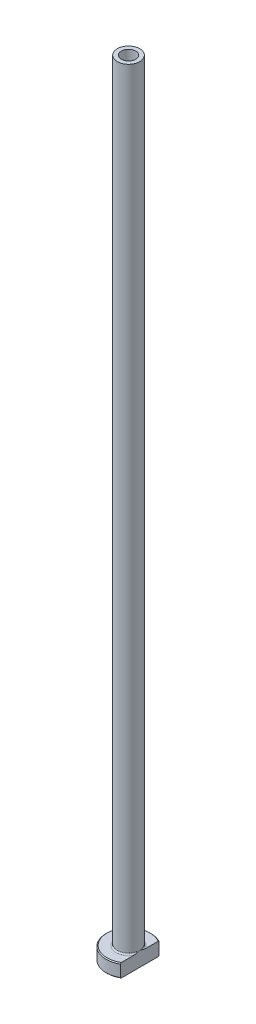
ISO-10303-21;
HEADER;
FILE_DESCRIPTION(('STEP AP214'),'2;1');
FILE_NAME('part.step','',(''),(''),'','','');
FILE_SCHEMA(('AUTOMOTIVE_DESIGN { 1 0 10303 214 1 1 1 1 }'));
ENDSEC;
DATA;
#1=APPLICATION_CONTEXT('core data for automotive mechanical design processes');
#2=APPLICATION_PROTOCOL_DEFINITION('international standard','automotive_design',2000,#1);
#3=PRODUCT_CONTEXT('',#1,'mechanical');
#4=PRODUCT('Part','Part','',(#3));
#5=PRODUCT_RELATED_PRODUCT_CATEGORY('part','',(#4));
#6=PRODUCT_DEFINITION_FORMATION('','',#4);
#7=PRODUCT_DEFINITION_CONTEXT('part definition',#1,'design');
#8=PRODUCT_DEFINITION('design','',#6,#7);
#9=PRODUCT_DEFINITION_SHAPE('','',#8);
#10=(LENGTH_UNIT() NAMED_UNIT(*) SI_UNIT(.MILLI.,.METRE.));
#11=(NAMED_UNIT(*) PLANE_ANGLE_UNIT() SI_UNIT($,.RADIAN.));
#12=(NAMED_UNIT(*) SI_UNIT($,.STERADIAN.) SOLID_ANGLE_UNIT());
#13=UNCERTAINTY_MEASURE_WITH_UNIT(LENGTH_MEASURE(1.E-05),#10,'distance_accuracy_value','');
#14=(GEOMETRIC_REPRESENTATION_CONTEXT(3) GLOBAL_UNCERTAINTY_ASSIGNED_CONTEXT((#13)) GLOBAL_UNIT_ASSIGNED_CONTEXT((#10,
#11,#12)) REPRESENTATION_CONTEXT('',''));
#15=CARTESIAN_POINT('',(0.,0.,0.));
#16=DIRECTION('',(0.,0.,1.));
#17=DIRECTION('',(1.,0.,0.));
#18=AXIS2_PLACEMENT_3D('',#15,#16,#17);
#19=CARTESIAN_POINT('',(0.,92.1876809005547,0.));
#20=DIRECTION('',(0.,1.,0.));
#21=DIRECTION('',(0.,0.,1.));
#22=AXIS2_PLACEMENT_3D('',#19,#20,#21);
#23=CYLINDRICAL_SURFACE('',#22,1.6);
#24=CARTESIAN_POINT('',(0.,175.,0.));
#25=DIRECTION('',(0.,1.,0.));
#26=DIRECTION('',(0.,0.,1.));
#27=AXIS2_PLACEMENT_3D('',#24,#25,#26);
#28=CIRCLE('',#27,1.6);
#29=CARTESIAN_POINT('',(0.,175.,1.6));
#30=VERTEX_POINT('',#29);
#31=EDGE_CURVE('E167',#30,#30,#28,.T.);
#32=ORIENTED_EDGE('',*,*,#31,.T.);
#33=EDGE_LOOP('',(#32));
#34=FACE_BOUND('',#33,.T.);
#35=CARTESIAN_POINT('',(0.,130.,0.));
#36=DIRECTION('',(0.,1.,0.));
#37=DIRECTION('',(0.,0.,1.));
#38=AXIS2_PLACEMENT_3D('',#35,#36,#37);
#39=CIRCLE('',#38,1.6);
#40=CARTESIAN_POINT('',(0.,130.,1.6));
#41=VERTEX_POINT('',#40);
#42=EDGE_CURVE('E170',#41,#41,#39,.T.);
#43=ORIENTED_EDGE('',*,*,#42,.F.);
#44=EDGE_LOOP('',(#43));
#45=FACE_BOUND('',#44,.T.);
#46=ADVANCED_FACE('F32',(#34,#45),#23,.F.);
#47=CARTESIAN_POINT('',(-1.6,175.,0.));
#48=DIRECTION('',(0.,1.,0.));
#49=DIRECTION('',(0.,0.,1.));
#50=AXIS2_PLACEMENT_3D('',#47,#48,#49);
#51=PLANE('',#50);
#52=CARTESIAN_POINT('',(0.,175.,0.));
#53=DIRECTION('',(0.,1.,0.));
#54=DIRECTION('',(0.,0.,1.));
#55=AXIS2_PLACEMENT_3D('',#52,#53,#54);
#56=CIRCLE('',#55,2.50000000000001);
#57=CARTESIAN_POINT('',(0.,175.,2.50000000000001));
#58=VERTEX_POINT('',#57);
#59=EDGE_CURVE('E174',#58,#58,#56,.T.);
#60=ORIENTED_EDGE('',*,*,#59,.T.);
#61=EDGE_LOOP('',(#60));
#62=FACE_BOUND('',#61,.T.);
#63=ORIENTED_EDGE('',*,*,#31,.F.);
#64=EDGE_LOOP('',(#63));
#65=FACE_BOUND('',#64,.T.);
#66=ADVANCED_FACE('F157',(#62,#65),#51,.T.);
#67=CARTESIAN_POINT('',(0.,92.1876809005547,0.));
#68=DIRECTION('',(0.,1.,0.));
#69=DIRECTION('',(0.,0.,1.));
#70=AXIS2_PLACEMENT_3D('',#67,#68,#69);
#71=CYLINDRICAL_SURFACE('',#70,2.5);
#72=CARTESIAN_POINT('',(0.,3.3,0.));
#73=DIRECTION('',(0.,1.,0.));
#74=DIRECTION('',(0.,0.,1.));
#75=AXIS2_PLACEMENT_3D('',#72,#73,#74);
#76=CIRCLE('',#75,2.5);
#77=CARTESIAN_POINT('',(2.5,3.3,0.));
#78=VERTEX_POINT('',#77);
#79=EDGE_CURVE('E180',#78,#78,#76,.T.);
#80=ORIENTED_EDGE('',*,*,#79,.T.);
#81=EDGE_LOOP('',(#80));
#82=FACE_BOUND('',#81,.T.);
#83=ORIENTED_EDGE('',*,*,#59,.F.);
#84=EDGE_LOOP('',(#83));
#85=FACE_BOUND('',#84,.T.);
#86=ADVANCED_FACE('F162',(#82,#85),#71,.T.);
#87=CARTESIAN_POINT('',(-2.49999999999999,3.,0.));
#88=DIRECTION('',(0.,1.,0.));
#89=DIRECTION('',(0.,0.,1.));
#90=AXIS2_PLACEMENT_3D('',#87,#88,#89);
#91=PLANE('',#90);
#92=DIRECTION('',(0.,0.,1.));
#93=VECTOR('',#92,1.);
#94=CARTESIAN_POINT('',(2.49999999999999,3.,0.));
#95=LINE('',#94,#93);
#96=CARTESIAN_POINT('',(2.49999999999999,3.,-4.09756024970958));
#97=VERTEX_POINT('',#96);
#98=CARTESIAN_POINT('',(2.49999999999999,3.,-1.26095202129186));
#99=VERTEX_POINT('',#98);
#100=EDGE_CURVE('E54',#97,#99,#95,.T.);
#101=ORIENTED_EDGE('',*,*,#100,.F.);
#102=CARTESIAN_POINT('',(0.,3.,0.));
#103=DIRECTION('',(0.,1.,0.));
#104=DIRECTION('',(0.,0.,1.));
#105=AXIS2_PLACEMENT_3D('',#102,#103,#104);
#106=CIRCLE('',#105,4.8);
#107=CARTESIAN_POINT('',(2.49999999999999,3.,4.09756024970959));
#108=VERTEX_POINT('',#107);
#109=EDGE_CURVE('E186',#97,#108,#106,.T.);
#110=ORIENTED_EDGE('',*,*,#109,.T.);
#111=CARTESIAN_POINT('',(2.49999999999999,3.,1.26095202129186));
#112=VERTEX_POINT('',#111);
#113=EDGE_CURVE('E134',#112,#108,#95,.T.);
#114=ORIENTED_EDGE('',*,*,#113,.F.);
#115=CARTESIAN_POINT('',(0.,3.,0.));
#116=DIRECTION('',(0.,1.,0.));
#117=DIRECTION('',(0.,0.,1.));
#118=AXIS2_PLACEMENT_3D('',#115,#116,#117);
#119=CIRCLE('',#118,2.8);
#120=EDGE_CURVE('E183',#112,#99,#119,.F.);
#121=ORIENTED_EDGE('',*,*,#120,.T.);
#122=EDGE_LOOP('',(#101,#110,#114,#121));
#123=FACE_BOUND('',#122,.T.);
#124=ADVANCED_FACE('F197',(#123),#91,.T.);
#125=CARTESIAN_POINT('',(0.,92.1876809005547,0.));
#126=DIRECTION('',(0.,1.,0.));
#127=DIRECTION('',(0.,0.,1.));
#128=AXIS2_PLACEMENT_3D('',#125,#126,#127);
#129=CYLINDRICAL_SURFACE('',#128,4.99999999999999);
#130=DIRECTION('',(0.,-1.,0.));
#131=VECTOR('',#130,1.);
#132=CARTESIAN_POINT('',(2.49999999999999,175.,4.33012701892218));
#133=LINE('',#132,#131);
#134=CARTESIAN_POINT('',(2.49999999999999,2.8,4.33012701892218));
#135=VERTEX_POINT('',#134);
#136=CARTESIAN_POINT('',(2.49999999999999,0.200000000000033,4.33012701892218));
#137=VERTEX_POINT('',#136);
#138=EDGE_CURVE('E82',#135,#137,#133,.T.);
#139=ORIENTED_EDGE('',*,*,#138,.F.);
#140=CARTESIAN_POINT('',(0.,2.8,0.));
#141=DIRECTION('',(0.,1.,0.));
#142=DIRECTION('',(0.,0.,1.));
#143=AXIS2_PLACEMENT_3D('',#140,#141,#142);
#144=CIRCLE('',#143,4.99999999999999);
#145=CARTESIAN_POINT('',(2.49999999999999,2.8,-4.33012701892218));
#146=VERTEX_POINT('',#145);
#147=EDGE_CURVE('E95',#135,#146,#144,.F.);
#148=ORIENTED_EDGE('',*,*,#147,.T.);
#149=DIRECTION('',(0.,-1.,0.));
#150=VECTOR('',#149,1.);
#151=CARTESIAN_POINT('',(2.49999999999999,175.,-4.33012701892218));
#152=LINE('',#151,#150);
#153=CARTESIAN_POINT('',(2.49999999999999,0.200000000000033,-4.33012701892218));
#154=VERTEX_POINT('',#153);
#155=EDGE_CURVE('E192',#146,#154,#152,.T.);
#156=ORIENTED_EDGE('',*,*,#155,.T.);
#157=CARTESIAN_POINT('',(0.,0.200000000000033,0.));
#158=DIRECTION('',(0.,-1.,0.));
#159=DIRECTION('',(0.,0.,-1.));
#160=AXIS2_PLACEMENT_3D('',#157,#158,#159);
#161=CIRCLE('',#160,4.99999999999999);
#162=EDGE_CURVE('E98',#154,#137,#161,.F.);
#163=ORIENTED_EDGE('',*,*,#162,.T.);
#164=EDGE_LOOP('',(#139,#148,#156,#163));
#165=FACE_BOUND('',#164,.T.);
#166=ADVANCED_FACE('F190',(#165),#129,.T.);
#167=CARTESIAN_POINT('',(-4.99999999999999,0.,0.));
#168=DIRECTION('',(0.,-1.,0.));
#169=DIRECTION('',(0.,0.,-1.));
#170=AXIS2_PLACEMENT_3D('',#167,#168,#169);
#171=PLANE('',#170);
#172=CARTESIAN_POINT('',(0.,0.,0.));
#173=DIRECTION('',(0.,-1.,0.));
#174=DIRECTION('',(0.,0.,-1.));
#175=AXIS2_PLACEMENT_3D('',#172,#173,#174);
#176=CIRCLE('',#175,2.34999999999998);
#177=CARTESIAN_POINT('',(0.,0.,-2.34999999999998));
#178=VERTEX_POINT('',#177);
#179=EDGE_CURVE('E40',#178,#178,#176,.F.);
#180=ORIENTED_EDGE('',*,*,#179,.T.);
#181=EDGE_LOOP('',(#180));
#182=FACE_BOUND('',#181,.T.);
#183=DIRECTION('',(0.,0.,-1.));
#184=VECTOR('',#183,1.);
#185=CARTESIAN_POINT('',(2.49999999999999,0.,4.33012701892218));
#186=LINE('',#185,#184);
#187=CARTESIAN_POINT('',(2.49999999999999,0.,4.09756024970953));
#188=VERTEX_POINT('',#187);
#189=CARTESIAN_POINT('',(2.49999999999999,0.,-4.09756024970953));
#190=VERTEX_POINT('',#189);
#191=EDGE_CURVE('E47',#188,#190,#186,.T.);
#192=ORIENTED_EDGE('',*,*,#191,.F.);
#193=CARTESIAN_POINT('',(0.,0.,0.));
#194=DIRECTION('',(0.,-1.,0.));
#195=DIRECTION('',(0.,0.,-1.));
#196=AXIS2_PLACEMENT_3D('',#193,#194,#195);
#197=CIRCLE('',#196,4.79999999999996);
#198=EDGE_CURVE('E92',#188,#190,#197,.T.);
#199=ORIENTED_EDGE('',*,*,#198,.T.);
#200=EDGE_LOOP('',(#192,#199));
#201=FACE_BOUND('',#200,.T.);
#202=ADVANCED_FACE('F91',(#182,#201),#171,.T.);
#203=CARTESIAN_POINT('',(0.,92.1876809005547,0.));
#204=DIRECTION('',(0.,1.,0.));
#205=DIRECTION('',(0.,0.,1.));
#206=AXIS2_PLACEMENT_3D('',#203,#204,#205);
#207=CYLINDRICAL_SURFACE('',#206,1.85);
#208=CARTESIAN_POINT('',(0.,0.499999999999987,0.));
#209=DIRECTION('',(0.,-1.,0.));
#210=DIRECTION('',(0.,0.,-1.));
#211=AXIS2_PLACEMENT_3D('',#208,#209,#210);
#212=CIRCLE('',#211,1.85);
#213=CARTESIAN_POINT('',(0.,0.499999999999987,-1.85));
#214=VERTEX_POINT('',#213);
#215=EDGE_CURVE('E11',#214,#214,#212,.T.);
#216=ORIENTED_EDGE('',*,*,#215,.T.);
#217=EDGE_LOOP('',(#216));
#218=FACE_BOUND('',#217,.T.);
#219=CARTESIAN_POINT('',(0.,118.,0.));
#220=DIRECTION('',(0.,1.,0.));
#221=DIRECTION('',(0.,0.,1.));
#222=AXIS2_PLACEMENT_3D('',#219,#220,#221);
#223=CIRCLE('',#222,1.85);
#224=CARTESIAN_POINT('',(0.,118.,1.85));
#225=VERTEX_POINT('',#224);
#226=EDGE_CURVE('E172',#225,#225,#223,.T.);
#227=ORIENTED_EDGE('',*,*,#226,.T.);
#228=EDGE_LOOP('',(#227));
#229=FACE_BOUND('',#228,.T.);
#230=ADVANCED_FACE('F215',(#218,#229),#207,.F.);
#231=CARTESIAN_POINT('',(0.,118.,0.));
#232=DIRECTION('',(0.,-1.,0.));
#233=DIRECTION('',(0.,0.,-1.));
#234=AXIS2_PLACEMENT_3D('',#231,#232,#233);
#235=CONICAL_SURFACE('',#234,1.85,0.0208303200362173);
#236=ORIENTED_EDGE('',*,*,#42,.T.);
#237=EDGE_LOOP('',(#236));
#238=FACE_BOUND('',#237,.T.);
#239=ORIENTED_EDGE('',*,*,#226,.F.);
#240=EDGE_LOOP('',(#239));
#241=FACE_BOUND('',#240,.T.);
#242=ADVANCED_FACE('F111',(#238,#241),#235,.F.);
#243=CARTESIAN_POINT('',(0.,3.3,0.));
#244=DIRECTION('',(0.,1.,0.));
#245=DIRECTION('',(0.,0.,1.));
#246=AXIS2_PLACEMENT_3D('',#243,#244,#245);
#247=TOROIDAL_SURFACE('',#246,2.8,0.3);
#248=ORIENTED_EDGE('',*,*,#120,.F.);
#249=CARTESIAN_POINT('',(2.5,3.3,0.));
#250=CARTESIAN_POINT('',(2.5,3.30000062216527,-4.842640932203E-11));
#251=CARTESIAN_POINT('',(2.5,3.30000124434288,1.59621029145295E-07));
#252=CARTESIAN_POINT('',(2.5,3.30000243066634,6.45477909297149E-07));
#253=CARTESIAN_POINT('',(2.5,3.30000299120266,9.78480635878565E-07));
#254=CARTESIAN_POINT('',(2.5,3.3000041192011,1.77471971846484E-06));
#255=CARTESIAN_POINT('',(2.5,3.30000467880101,2.24902134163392E-06));
#256=CARTESIAN_POINT('',(2.5,3.30000572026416,3.25953670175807E-06));
#257=CARTESIAN_POINT('',(2.5,3.30000620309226,3.7948073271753E-06));
#258=CARTESIAN_POINT('',(2.5,3.30000787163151,5.75794622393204E-06));
#259=CARTESIAN_POINT('',(2.5,3.30000896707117,7.26424112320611E-06));
#260=CARTESIAN_POINT('',(2.5,3.30001087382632,1.0336113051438E-05));
#261=CARTESIAN_POINT('',(2.5,3.30001169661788,1.18949500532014E-05));
#262=CARTESIAN_POINT('',(2.5,3.30001489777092,1.81400854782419E-05));
#263=CARTESIAN_POINT('',(2.5,3.30001712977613,2.29062182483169E-05));
#264=CARTESIAN_POINT('',(2.5,3.3000206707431,3.21793872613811E-05));
#265=CARTESIAN_POINT('',(2.5,3.30002205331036,3.66588994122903E-05));
#266=CARTESIAN_POINT('',(2.5,3.30002810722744,5.61718413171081E-05));
#267=CARTESIAN_POINT('',(2.5,3.30003284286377,7.11735877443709E-05));
#268=CARTESIAN_POINT('',(2.5,3.30004025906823,9.89920342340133E-05));
#269=CARTESIAN_POINT('',(2.49999999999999,3.30004315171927,0.000111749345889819));
#270=CARTESIAN_POINT('',(2.49999999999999,3.30006652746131,0.000206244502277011));
#271=CARTESIAN_POINT('',(2.49999999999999,3.30009698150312,0.000285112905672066));
#272=CARTESIAN_POINT('',(2.5,3.30021213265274,0.000594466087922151));
#273=CARTESIAN_POINT('',(2.5,3.30028938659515,0.000826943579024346));
#274=CARTESIAN_POINT('',(2.49999999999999,3.30059681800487,0.00173885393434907));
#275=CARTESIAN_POINT('',(2.49999999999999,3.30083479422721,0.00241625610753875));
#276=CARTESIAN_POINT('',(2.5,3.30181198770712,0.00521069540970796));
#277=CARTESIAN_POINT('',(2.5,3.30254240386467,0.00732996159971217));
#278=CARTESIAN_POINT('',(2.49999999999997,3.31226043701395,0.0355096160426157));
#279=CARTESIAN_POINT('',(2.49999999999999,3.32130808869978,0.0615551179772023));
#280=CARTESIAN_POINT('',(2.5,3.33896212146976,0.112677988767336));
#281=CARTESIAN_POINT('',(2.5,3.34757212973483,0.137754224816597));
#282=CARTESIAN_POINT('',(2.49999999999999,3.36573068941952,0.190981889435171));
#283=CARTESIAN_POINT('',(2.49999999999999,3.37526654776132,0.219137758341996));
#284=CARTESIAN_POINT('',(2.49999999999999,3.39422867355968,0.275816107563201));
#285=CARTESIAN_POINT('',(2.49999999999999,3.40365272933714,0.304339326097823));
#286=CARTESIAN_POINT('',(2.49999999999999,3.42641697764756,0.374416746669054));
#287=CARTESIAN_POINT('',(2.49999999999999,3.43959811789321,0.416023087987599));
#288=CARTESIAN_POINT('',(2.49999999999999,3.46479157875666,0.498481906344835));
#289=CARTESIAN_POINT('',(2.49999999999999,3.47682455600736,0.539328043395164));
#290=CARTESIAN_POINT('',(2.49999999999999,3.50224427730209,0.629981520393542));
#291=CARTESIAN_POINT('',(2.49999999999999,3.5153804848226,0.679860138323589));
#292=CARTESIAN_POINT('',(2.49999999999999,3.53964074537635,0.780511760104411));
#293=CARTESIAN_POINT('',(2.49999999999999,3.55074877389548,0.831288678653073));
#294=CARTESIAN_POINT('',(2.49999999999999,3.57087054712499,0.937063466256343));
#295=CARTESIAN_POINT('',(2.49999999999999,3.57967623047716,0.992102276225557));
#296=CARTESIAN_POINT('',(2.49999999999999,3.59301148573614,1.10256024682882));
#297=CARTESIAN_POINT('',(2.49999999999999,3.59755297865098,1.15797790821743));
#298=CARTESIAN_POINT('',(2.49999999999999,3.60093314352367,1.26786705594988));
#299=CARTESIAN_POINT('',(2.49999999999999,3.59989366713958,1.32233291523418));
#300=CARTESIAN_POINT('',(2.49999999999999,3.59277279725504,1.403100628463));
#301=CARTESIAN_POINT('',(2.49999999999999,3.58952137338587,1.42965222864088));
#302=CARTESIAN_POINT('',(2.49999999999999,3.58085857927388,1.48239078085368));
#303=CARTESIAN_POINT('',(2.49999999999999,3.57544928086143,1.50857805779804));
#304=CARTESIAN_POINT('',(2.49999999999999,3.56298810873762,1.55658799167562));
#305=CARTESIAN_POINT('',(2.49999999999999,3.55628200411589,1.57849902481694));
#306=CARTESIAN_POINT('',(2.49999999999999,3.54055393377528,1.62160292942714));
#307=CARTESIAN_POINT('',(2.49999999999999,3.53152220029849,1.64279233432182));
#308=CARTESIAN_POINT('',(2.49999999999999,3.51057199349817,1.6840446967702));
#309=CARTESIAN_POINT('',(2.49999999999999,3.49862012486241,1.704091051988));
#310=CARTESIAN_POINT('',(2.49999999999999,3.47134074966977,1.74172093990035));
#311=CARTESIAN_POINT('',(2.49999999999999,3.45603127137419,1.75931683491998));
#312=CARTESIAN_POINT('',(2.49999999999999,3.42979930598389,1.78297070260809));
#313=CARTESIAN_POINT('',(2.49999999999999,3.42024268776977,1.79054141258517));
#314=CARTESIAN_POINT('',(2.49999999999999,3.40009035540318,1.80416997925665));
#315=CARTESIAN_POINT('',(2.49999999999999,3.38949499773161,1.81022835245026));
#316=CARTESIAN_POINT('',(2.49999999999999,3.36727740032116,1.82047087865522));
#317=CARTESIAN_POINT('',(2.49999999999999,3.35564531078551,1.82463409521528));
#318=CARTESIAN_POINT('',(2.49999999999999,3.33178837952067,1.83058442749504));
#319=CARTESIAN_POINT('',(2.49999999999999,3.31956435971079,1.83237474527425));
#320=CARTESIAN_POINT('',(2.49999999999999,3.29665736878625,1.83331852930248));
#321=CARTESIAN_POINT('',(2.49999999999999,3.2859867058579,1.83279233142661));
#322=CARTESIAN_POINT('',(2.49999999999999,3.26490749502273,1.82986307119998));
#323=CARTESIAN_POINT('',(2.49999999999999,3.25449899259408,1.82745968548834));
#324=CARTESIAN_POINT('',(2.49999999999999,3.23467098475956,1.82111257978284));
#325=CARTESIAN_POINT('',(2.49999999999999,3.22522816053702,1.81724026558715));
#326=CARTESIAN_POINT('',(2.49999999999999,3.20699535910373,1.80819497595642));
#327=CARTESIAN_POINT('',(2.49999999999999,3.19820556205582,1.80302164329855));
#328=CARTESIAN_POINT('',(2.49999999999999,3.1766316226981,1.78842115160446));
#329=CARTESIAN_POINT('',(2.49999999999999,3.16436228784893,1.77823293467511));
#330=CARTESIAN_POINT('',(2.49999999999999,3.14157828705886,1.75604629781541));
#331=CARTESIAN_POINT('',(2.49999999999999,3.13106906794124,1.74404246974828));
#332=CARTESIAN_POINT('',(2.49999999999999,3.10600520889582,1.71142114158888));
#333=CARTESIAN_POINT('',(2.49999999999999,3.09267476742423,1.68986887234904));
#334=CARTESIAN_POINT('',(2.49999999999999,3.06940323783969,1.64508572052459));
#335=CARTESIAN_POINT('',(2.49999999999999,3.05946314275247,1.62185434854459));
#336=CARTESIAN_POINT('',(2.49999999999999,3.03545750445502,1.55546754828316));
#337=CARTESIAN_POINT('',(2.49999999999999,3.02444022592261,1.51122187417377));
#338=CARTESIAN_POINT('',(2.49999999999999,3.00863926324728,1.42119777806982));
#339=CARTESIAN_POINT('',(2.49999999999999,3.00393876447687,1.37540689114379));
#340=CARTESIAN_POINT('',(2.49999999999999,2.9992421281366,1.28072198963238));
#341=CARTESIAN_POINT('',(2.49999999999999,2.99956098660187,1.23181420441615));
#342=CARTESIAN_POINT('',(2.49999999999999,3.00436098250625,1.13410944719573));
#343=CARTESIAN_POINT('',(2.49999999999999,3.00885327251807,1.08531312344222));
#344=CARTESIAN_POINT('',(2.49999999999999,3.02074191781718,0.990773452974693));
#345=CARTESIAN_POINT('',(2.49999999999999,3.02796792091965,0.945007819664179));
#346=CARTESIAN_POINT('',(2.49999999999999,3.04465555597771,0.854199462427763));
#347=CARTESIAN_POINT('',(2.49999999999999,3.05410250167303,0.809153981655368));
#348=CARTESIAN_POINT('',(2.49999999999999,3.07710029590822,0.709411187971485));
#349=CARTESIAN_POINT('',(2.49999999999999,3.09109633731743,0.654817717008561));
#350=CARTESIAN_POINT('',(2.49999999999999,3.12140740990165,0.544863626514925));
#351=CARTESIAN_POINT('',(2.49999999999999,3.13777040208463,0.489516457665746));
#352=CARTESIAN_POINT('',(2.49999999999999,3.16649540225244,0.396740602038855));
#353=CARTESIAN_POINT('',(2.5,3.17848130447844,0.35919385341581));
#354=CARTESIAN_POINT('',(2.49999999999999,3.20280507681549,0.284651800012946));
#355=CARTESIAN_POINT('',(2.49999999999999,3.21513791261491,0.24765485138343));
#356=CARTESIAN_POINT('',(2.5,3.23873713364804,0.177767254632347));
#357=CARTESIAN_POINT('',(2.50000000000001,3.24997409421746,0.144866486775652));
#358=CARTESIAN_POINT('',(2.49999999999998,3.27307149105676,0.0777985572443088));
#359=CARTESIAN_POINT('',(2.49999999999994,3.28493883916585,0.0436336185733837));
#360=CARTESIAN_POINT('',(2.5,3.29745794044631,0.00732879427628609));
#361=CARTESIAN_POINT('',(2.5,3.2981887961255,0.00520838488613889));
#362=CARTESIAN_POINT('',(2.49999999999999,3.2991661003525,0.0024136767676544));
#363=CARTESIAN_POINT('',(2.49999999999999,3.2994037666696,0.00173715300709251));
#364=CARTESIAN_POINT('',(2.5,3.29971082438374,0.000826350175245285));
#365=CARTESIAN_POINT('',(2.5,3.29978800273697,0.0005940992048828));
#366=CARTESIAN_POINT('',(2.49999999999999,3.29990305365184,0.000285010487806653));
#367=CARTESIAN_POINT('',(2.49999999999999,3.29993349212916,0.00020618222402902));
#368=CARTESIAN_POINT('',(2.5,3.29995685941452,0.000111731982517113));
#369=CARTESIAN_POINT('',(2.5,3.29995975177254,9.89774331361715E-05));
#370=CARTESIAN_POINT('',(2.5,3.29996716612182,7.11651889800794E-05));
#371=CARTESIAN_POINT('',(2.5,3.2999718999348,5.61668099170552E-05));
#372=CARTESIAN_POINT('',(2.5,3.2999779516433,3.66576329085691E-05));
#373=CARTESIAN_POINT('',(2.5,3.29997933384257,3.21785245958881E-05));
#374=CARTESIAN_POINT('',(2.5,3.29998287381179,2.29061375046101E-05));
#375=CARTESIAN_POINT('',(2.5,3.29998510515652,1.81403660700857E-05));
#376=CARTESIAN_POINT('',(2.5,3.29998830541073,1.18955821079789E-05));
#377=CARTESIAN_POINT('',(2.5,3.29998912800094,1.0336776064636E-05));
#378=CARTESIAN_POINT('',(2.5,3.29999103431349,7.26492766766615E-06));
#379=CARTESIAN_POINT('',(2.5,3.29999212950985,5.75862261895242E-06));
#380=CARTESIAN_POINT('',(2.5,3.2999937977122,3.79542447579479E-06));
#381=CARTESIAN_POINT('',(2.5,3.29999428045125,3.26012741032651E-06));
#382=CARTESIAN_POINT('',(2.5,3.29999532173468,2.24954314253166E-06));
#383=CARTESIAN_POINT('',(2.5,3.29999588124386,1.77519877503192E-06));
#384=CARTESIAN_POINT('',(2.5,3.29999700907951,9.78856969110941E-07));
#385=CARTESIAN_POINT('',(2.5,3.29999756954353,6.45796955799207E-07));
#386=CARTESIAN_POINT('',(2.5,3.29999875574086,1.5979956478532E-07));
#387=CARTESIAN_POINT('',(2.5,3.29999937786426,4.84246108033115E-11));
#388=CARTESIAN_POINT('',(2.5,3.3,0.));
#389=B_SPLINE_CURVE_WITH_KNOTS('',3,(#249,#250,#251,#252,#253,#254,#255,#256,#257,#258,#259,
#260,#261,#262,#263,#264,#265,#266,#267,#268,#269,#270,#271,#272,#273,#274,#275,#276,#277,#278,
#279,#280,#281,#282,#283,#284,#285,#286,#287,#288,#289,#290,#291,#292,#293,#294,#295,#296,#297,
#298,#299,#300,#301,#302,#303,#304,#305,#306,#307,#308,#309,#310,#311,#312,#313,#314,#315,#316,
#317,#318,#319,#320,#321,#322,#323,#324,#325,#326,#327,#328,#329,#330,#331,#332,#333,#334,#335,
#336,#337,#338,#339,#340,#341,#342,#343,#344,#345,#346,#347,#348,#349,#350,#351,#352,#353,#354,
#355,#356,#357,#358,#359,#360,#361,#362,#363,#364,#365,#366,#367,#368,#369,#370,#371,#372,#373,
#374,#375,#376,#377,#378,#379,#380,#381,#382,#383,#384,#385,#386,#387,#388),.UNSPECIFIED.,.T.,
.F.,(4,2,2,2,2,2,2,2,2,2,2,2,2,2,2,2,2,2,2,2,2,2,2,2,2,2,2,2,2,2,2,2,2,2,2,2,2,2,2,2,2,2,2,2,2,
2,2,2,2,2,2,2,2,2,2,2,2,2,2,2,2,2,2,2,2,2,2,2,2,4),(0.,1.86789232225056E-06,
3.81549610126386E-06,6.00610466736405E-06,8.16652962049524E-06,1.37285588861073E-05,
1.90122169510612E-05,3.47597289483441E-05,4.88082617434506E-05,9.59978449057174E-05,
0.000135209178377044,0.000388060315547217,0.00112364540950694,0.00327678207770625,
0.0100024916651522,0.0927120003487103,0.17225321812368,0.261432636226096,0.351551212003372,
0.482477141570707,0.610212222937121,0.764915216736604,0.920792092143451,1.08787897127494,
1.25449733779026,1.41749285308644,1.49767530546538,1.57778095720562,1.64642481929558,
1.71536183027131,1.78512750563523,1.85452737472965,1.89099315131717,1.92744645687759,
1.96429324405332,2.00109025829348,2.03297105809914,2.0648573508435,2.09535926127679,
2.12586955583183,2.17344034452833,2.22115572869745,2.29675134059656,2.37236907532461,
2.50839721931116,2.64619971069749,2.79268284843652,2.93955855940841,3.07848421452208,
3.21651583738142,3.38554045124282,3.55865938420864,3.67689643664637,3.79388863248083,
3.89819085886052,4.00668323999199,4.01341261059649,4.0155629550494,4.01629782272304,
4.01655054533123,4.01658974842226,4.01663692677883,4.01665097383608,4.01666671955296,
4.01667200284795,4.01667756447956,4.01667972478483,4.01668191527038,4.01668386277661,
4.01668573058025),.UNSPECIFIED.);
#390=EDGE_CURVE('E126',#112,#78,#389,.T.);
#391=ORIENTED_EDGE('',*,*,#390,.T.);
#392=ORIENTED_EDGE('',*,*,#79,.F.);
#393=CARTESIAN_POINT('',(2.5,3.3,0.));
#394=CARTESIAN_POINT('',(2.5,3.29999937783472,4.84269968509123E-11));
#395=CARTESIAN_POINT('',(2.5,3.29999875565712,-1.59621028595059E-07));
#396=CARTESIAN_POINT('',(2.5,3.29999756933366,-6.4547790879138E-07));
#397=CARTESIAN_POINT('',(2.5,3.29999700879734,-9.78480635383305E-07));
#398=CARTESIAN_POINT('',(2.5,3.2999958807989,-1.77471971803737E-06));
#399=CARTESIAN_POINT('',(2.5,3.29999532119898,-2.24902134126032E-06));
#400=CARTESIAN_POINT('',(2.5,3.29999427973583,-3.25953670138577E-06));
#401=CARTESIAN_POINT('',(2.5,3.29999379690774,-3.79480732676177E-06));
#402=CARTESIAN_POINT('',(2.5,3.29999212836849,-5.75794622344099E-06));
#403=CARTESIAN_POINT('',(2.5,3.29999103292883,-7.2642411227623E-06));
#404=CARTESIAN_POINT('',(2.5,3.29998912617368,-1.03361130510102E-05));
#405=CARTESIAN_POINT('',(2.5,3.29998830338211,-1.18949500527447E-05));
#406=CARTESIAN_POINT('',(2.5,3.29998510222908,-1.81400854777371E-05));
#407=CARTESIAN_POINT('',(2.5,3.29998287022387,-2.29062182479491E-05));
#408=CARTESIAN_POINT('',(2.5,3.2999793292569,-3.21793872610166E-05));
#409=CARTESIAN_POINT('',(2.5,3.29997794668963,-3.66588994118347E-05));
#410=CARTESIAN_POINT('',(2.49999999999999,3.29997189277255,-5.61718413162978E-05));
#411=CARTESIAN_POINT('',(2.49999999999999,3.29996715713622,-7.11735877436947E-05));
#412=CARTESIAN_POINT('',(2.49999999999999,3.29995974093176,-9.89920342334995E-05));
#413=CARTESIAN_POINT('',(2.49999999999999,3.29995684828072,-0.000111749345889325));
#414=CARTESIAN_POINT('',(2.49999999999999,3.29993347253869,-0.000206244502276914));
#415=CARTESIAN_POINT('',(2.49999999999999,3.29990301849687,-0.000285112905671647));
#416=CARTESIAN_POINT('',(2.49999999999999,3.29978786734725,-0.000594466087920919));
#417=CARTESIAN_POINT('',(2.49999999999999,3.29971061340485,-0.000826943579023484));
#418=CARTESIAN_POINT('',(2.49999999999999,3.29940318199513,-0.00173885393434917));
#419=CARTESIAN_POINT('',(2.49999999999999,3.29916520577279,-0.00241625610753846));
#420=CARTESIAN_POINT('',(2.49999999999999,3.29818801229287,-0.00521069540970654));
#421=CARTESIAN_POINT('',(2.49999999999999,3.29745759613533,-0.00732996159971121));
#422=CARTESIAN_POINT('',(2.5,3.28773956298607,-0.0355096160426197));
#423=CARTESIAN_POINT('',(2.5,3.27869191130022,-0.0615551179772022));
#424=CARTESIAN_POINT('',(2.49999999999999,3.26103787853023,-0.112677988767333));
#425=CARTESIAN_POINT('',(2.49999999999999,3.25242787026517,-0.137754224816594));
#426=CARTESIAN_POINT('',(2.49999999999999,3.23426931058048,-0.190981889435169));
#427=CARTESIAN_POINT('',(2.49999999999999,3.22473345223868,-0.219137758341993));
#428=CARTESIAN_POINT('',(2.49999999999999,3.20577132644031,-0.275816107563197));
#429=CARTESIAN_POINT('',(2.49999999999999,3.19634727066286,-0.304339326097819));
#430=CARTESIAN_POINT('',(2.49999999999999,3.17358302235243,-0.37441674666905));
#431=CARTESIAN_POINT('',(2.49999999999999,3.16040188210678,-0.416023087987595));
#432=CARTESIAN_POINT('',(2.49999999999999,3.13520842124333,-0.498481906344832));
#433=CARTESIAN_POINT('',(2.49999999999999,3.12317544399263,-0.539328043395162));
#434=CARTESIAN_POINT('',(2.49999999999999,3.0977557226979,-0.629981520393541));
#435=CARTESIAN_POINT('',(2.49999999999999,3.0846195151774,-0.67986013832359));
#436=CARTESIAN_POINT('',(2.49999999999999,3.06035925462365,-0.780511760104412));
#437=CARTESIAN_POINT('',(2.49999999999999,3.04925122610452,-0.831288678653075));
#438=CARTESIAN_POINT('',(2.49999999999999,3.029129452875,-0.937063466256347));
#439=CARTESIAN_POINT('',(2.49999999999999,3.02032376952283,-0.992102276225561));
#440=CARTESIAN_POINT('',(2.49999999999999,3.00698851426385,-1.10256024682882));
#441=CARTESIAN_POINT('',(2.49999999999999,3.00244702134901,-1.15797790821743));
#442=CARTESIAN_POINT('',(2.49999999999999,2.99906685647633,-1.26786705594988));
#443=CARTESIAN_POINT('',(2.49999999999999,3.00010633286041,-1.32233291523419));
#444=CARTESIAN_POINT('',(2.49999999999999,3.00722720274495,-1.40310062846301));
#445=CARTESIAN_POINT('',(2.49999999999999,3.01047862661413,-1.42965222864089));
#446=CARTESIAN_POINT('',(2.49999999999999,3.01914142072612,-1.48239078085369));
#447=CARTESIAN_POINT('',(2.49999999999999,3.02455071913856,-1.50857805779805));
#448=CARTESIAN_POINT('',(2.49999999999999,3.03701189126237,-1.55658799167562));
#449=CARTESIAN_POINT('',(2.49999999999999,3.04371799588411,-1.57849902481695));
#450=CARTESIAN_POINT('',(2.49999999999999,3.05944606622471,-1.62160292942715));
#451=CARTESIAN_POINT('',(2.49999999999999,3.06847779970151,-1.64279233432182));
#452=CARTESIAN_POINT('',(2.49999999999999,3.08942800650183,-1.6840446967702));
#453=CARTESIAN_POINT('',(2.49999999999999,3.10137987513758,-1.704091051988));
#454=CARTESIAN_POINT('',(2.49999999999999,3.12865925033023,-1.74172093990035));
#455=CARTESIAN_POINT('',(2.49999999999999,3.1439687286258,-1.75931683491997));
#456=CARTESIAN_POINT('',(2.49999999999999,3.1702006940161,-1.78297070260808));
#457=CARTESIAN_POINT('',(2.49999999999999,3.17975731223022,-1.79054141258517));
#458=CARTESIAN_POINT('',(2.49999999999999,3.19990964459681,-1.80416997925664));
#459=CARTESIAN_POINT('',(2.49999999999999,3.21050500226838,-1.81022835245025));
#460=CARTESIAN_POINT('',(2.49999999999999,3.23272259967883,-1.82047087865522));
#461=CARTESIAN_POINT('',(2.49999999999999,3.24435468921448,-1.82463409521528));
#462=CARTESIAN_POINT('',(2.49999999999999,3.26821162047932,-1.83058442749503));
#463=CARTESIAN_POINT('',(2.49999999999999,3.2804356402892,-1.83237474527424));
#464=CARTESIAN_POINT('',(2.49999999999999,3.30334263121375,-1.83331852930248));
#465=CARTESIAN_POINT('',(2.49999999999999,3.31401329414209,-1.83279233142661));
#466=CARTESIAN_POINT('',(2.49999999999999,3.33509250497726,-1.82986307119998));
#467=CARTESIAN_POINT('',(2.49999999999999,3.34550100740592,-1.82745968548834));
#468=CARTESIAN_POINT('',(2.49999999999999,3.36532901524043,-1.82111257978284));
#469=CARTESIAN_POINT('',(2.49999999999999,3.37477183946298,-1.81724026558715));
#470=CARTESIAN_POINT('',(2.49999999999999,3.39300464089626,-1.80819497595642));
#471=CARTESIAN_POINT('',(2.49999999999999,3.40179443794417,-1.80302164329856));
#472=CARTESIAN_POINT('',(2.49999999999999,3.42336837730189,-1.78842115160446));
#473=CARTESIAN_POINT('',(2.49999999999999,3.43563771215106,-1.77823293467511));
#474=CARTESIAN_POINT('',(2.49999999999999,3.45842171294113,-1.75604629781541));
#475=CARTESIAN_POINT('',(2.49999999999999,3.46893093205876,-1.74404246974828));
#476=CARTESIAN_POINT('',(2.49999999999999,3.49399479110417,-1.71142114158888));
#477=CARTESIAN_POINT('',(2.49999999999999,3.50732523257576,-1.68986887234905));
#478=CARTESIAN_POINT('',(2.49999999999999,3.5305967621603,-1.64508572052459));
#479=CARTESIAN_POINT('',(2.49999999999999,3.54053685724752,-1.6218543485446));
#480=CARTESIAN_POINT('',(2.49999999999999,3.56454249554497,-1.55546754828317));
#481=CARTESIAN_POINT('',(2.49999999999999,3.57555977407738,-1.51122187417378));
#482=CARTESIAN_POINT('',(2.49999999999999,3.59136073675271,-1.42119777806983));
#483=CARTESIAN_POINT('',(2.49999999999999,3.59606123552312,-1.37540689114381));
#484=CARTESIAN_POINT('',(2.49999999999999,3.6007578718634,-1.2807219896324));
#485=CARTESIAN_POINT('',(2.49999999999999,3.60043901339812,-1.23181420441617));
#486=CARTESIAN_POINT('',(2.49999999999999,3.59563901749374,-1.13410944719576));
#487=CARTESIAN_POINT('',(2.49999999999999,3.59114672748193,-1.08531312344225));
#488=CARTESIAN_POINT('',(2.49999999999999,3.57925808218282,-0.990773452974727));
#489=CARTESIAN_POINT('',(2.49999999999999,3.57203207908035,-0.945007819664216));
#490=CARTESIAN_POINT('',(2.49999999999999,3.55534444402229,-0.854199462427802));
#491=CARTESIAN_POINT('',(2.49999999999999,3.54589749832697,-0.809153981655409));
#492=CARTESIAN_POINT('',(2.49999999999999,3.52289970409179,-0.709411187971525));
#493=CARTESIAN_POINT('',(2.49999999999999,3.50890366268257,-0.654817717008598));
#494=CARTESIAN_POINT('',(2.49999999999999,3.47859259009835,-0.544863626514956));
#495=CARTESIAN_POINT('',(2.49999999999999,3.46222959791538,-0.489516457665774));
#496=CARTESIAN_POINT('',(2.49999999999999,3.43350459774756,-0.396740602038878));
#497=CARTESIAN_POINT('',(2.49999999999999,3.42151869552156,-0.35919385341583));
#498=CARTESIAN_POINT('',(2.49999999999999,3.39719492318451,-0.284651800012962));
#499=CARTESIAN_POINT('',(2.49999999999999,3.38486208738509,-0.247654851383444));
#500=CARTESIAN_POINT('',(2.5,3.36126286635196,-0.177767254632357));
#501=CARTESIAN_POINT('',(2.5,3.35002590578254,-0.14486648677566));
#502=CARTESIAN_POINT('',(2.49999999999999,3.32692850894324,-0.0777985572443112));
#503=CARTESIAN_POINT('',(2.49999999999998,3.31506116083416,-0.0436336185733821));
#504=CARTESIAN_POINT('',(2.5,3.30254205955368,-0.00732879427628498));
#505=CARTESIAN_POINT('',(2.5,3.3018112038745,-0.00520838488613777));
#506=CARTESIAN_POINT('',(2.49999999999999,3.3008338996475,-0.00241367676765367));
#507=CARTESIAN_POINT('',(2.49999999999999,3.30059623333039,-0.00173715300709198));
#508=CARTESIAN_POINT('',(2.49999999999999,3.30028917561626,-0.000826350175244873));
#509=CARTESIAN_POINT('',(2.5,3.30021199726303,-0.000594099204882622));
#510=CARTESIAN_POINT('',(2.49999999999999,3.30009694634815,-0.00028501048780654));
#511=CARTESIAN_POINT('',(2.49999999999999,3.30006650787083,-0.000206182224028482));
#512=CARTESIAN_POINT('',(2.49999999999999,3.30004314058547,-0.000111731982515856));
#513=CARTESIAN_POINT('',(2.49999999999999,3.30004024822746,-9.897743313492E-05));
#514=CARTESIAN_POINT('',(2.5,3.30003283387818,-7.11651889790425E-05));
#515=CARTESIAN_POINT('',(2.5,3.30002810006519,-5.61668099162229E-05));
#516=CARTESIAN_POINT('',(2.5,3.30002204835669,-3.66576329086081E-05));
#517=CARTESIAN_POINT('',(2.5,3.30002066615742,-3.21785245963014E-05));
#518=CARTESIAN_POINT('',(2.5,3.30001712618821,-2.29061375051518E-05));
#519=CARTESIAN_POINT('',(2.5,3.30001489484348,-1.81403660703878E-05));
#520=CARTESIAN_POINT('',(2.5,3.30001169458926,-1.18955821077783E-05));
#521=CARTESIAN_POINT('',(2.5,3.30001087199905,-1.03367760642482E-05));
#522=CARTESIAN_POINT('',(2.5,3.3000089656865,-7.26492766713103E-06));
#523=CARTESIAN_POINT('',(2.5,3.30000787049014,-5.758622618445E-06));
#524=CARTESIAN_POINT('',(2.5,3.30000620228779,-3.79542447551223E-06));
#525=CARTESIAN_POINT('',(2.5,3.30000571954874,-3.26012741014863E-06));
#526=CARTESIAN_POINT('',(2.5,3.30000467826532,-2.24954314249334E-06));
#527=CARTESIAN_POINT('',(2.5,3.30000411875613,-1.7751987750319E-06));
#528=CARTESIAN_POINT('',(2.5,3.30000299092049,-9.78856969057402E-07));
#529=CARTESIAN_POINT('',(2.5,3.30000243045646,-6.45796955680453E-07));
#530=CARTESIAN_POINT('',(2.5,3.30000124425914,-1.59799564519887E-07));
#531=CARTESIAN_POINT('',(2.5,3.30000062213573,-4.84241967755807E-11));
#532=CARTESIAN_POINT('',(2.5,3.3,0.));
#533=B_SPLINE_CURVE_WITH_KNOTS('',3,(#393,#394,#395,#396,#397,#398,#399,#400,#401,#402,#403,
#404,#405,#406,#407,#408,#409,#410,#411,#412,#413,#414,#415,#416,#417,#418,#419,#420,#421,#422,
#423,#424,#425,#426,#427,#428,#429,#430,#431,#432,#433,#434,#435,#436,#437,#438,#439,#440,#441,
#442,#443,#444,#445,#446,#447,#448,#449,#450,#451,#452,#453,#454,#455,#456,#457,#458,#459,#460,
#461,#462,#463,#464,#465,#466,#467,#468,#469,#470,#471,#472,#473,#474,#475,#476,#477,#478,#479,
#480,#481,#482,#483,#484,#485,#486,#487,#488,#489,#490,#491,#492,#493,#494,#495,#496,#497,#498,
#499,#500,#501,#502,#503,#504,#505,#506,#507,#508,#509,#510,#511,#512,#513,#514,#515,#516,#517,
#518,#519,#520,#521,#522,#523,#524,#525,#526,#527,#528,#529,#530,#531,#532),.UNSPECIFIED.,.T.,
.F.,(4,2,2,2,2,2,2,2,2,2,2,2,2,2,2,2,2,2,2,2,2,2,2,2,2,2,2,2,2,2,2,2,2,2,2,2,2,2,2,2,2,2,2,2,2,
2,2,2,2,2,2,2,2,2,2,2,2,2,2,2,2,2,2,2,2,2,2,2,2,4),(0.,1.86789232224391E-06,
3.81549610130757E-06,6.00610466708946E-06,8.16652962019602E-06,1.37285588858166E-05,
1.90122169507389E-05,3.47597289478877E-05,4.88082617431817E-05,9.59978449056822E-05,
0.000135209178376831,0.000388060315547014,0.00112364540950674,0.00327678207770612,
0.0100024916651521,0.0927120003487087,0.172253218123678,0.261432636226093,0.351551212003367,
0.482477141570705,0.61021222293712,0.764915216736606,0.920792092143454,1.08787897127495,
1.25449733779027,1.41749285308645,1.49767530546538,1.57778095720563,1.64642481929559,
1.71536183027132,1.78512750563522,1.85452737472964,1.89099315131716,1.92744645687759,
1.96429324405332,2.00109025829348,2.03297105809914,2.0648573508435,2.09535926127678,
2.12586955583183,2.17344034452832,2.22115572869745,2.29675134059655,2.37236907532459,
2.50839721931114,2.64619971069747,2.7926828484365,2.93955855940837,3.07848421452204,
3.21651583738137,3.38554045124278,3.55865938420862,3.67689643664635,3.79388863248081,
3.89819085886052,4.00668323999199,4.01341261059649,4.0155629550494,4.01629782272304,
4.01655054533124,4.01658974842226,4.01663692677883,4.01665097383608,4.01666671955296,
4.01667200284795,4.01667756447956,4.01667972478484,4.01668191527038,4.01668386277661,
4.01668573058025),.UNSPECIFIED.);
#534=EDGE_CURVE('E135',#78,#99,#533,.T.);
#535=ORIENTED_EDGE('',*,*,#534,.T.);
#536=EDGE_LOOP('',(#248,#391,#392,#535));
#537=FACE_BOUND('',#536,.T.);
#538=ADVANCED_FACE('F141',(#537),#247,.F.);
#539=CARTESIAN_POINT('',(0.,3.,0.));
#540=DIRECTION('',(0.,-1.,0.));
#541=DIRECTION('',(0.,0.,-1.));
#542=AXIS2_PLACEMENT_3D('',#539,#540,#541);
#543=CONICAL_SURFACE('',#542,4.8,0.785398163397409);
#544=CARTESIAN_POINT('',(2.5,-2.05039133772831,-9.52786489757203));
#545=CARTESIAN_POINT('',(2.5,-1.84160367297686,-9.31199733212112));
#546=CARTESIAN_POINT('',(2.5,-1.63304008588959,-9.09591231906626));
#547=CARTESIAN_POINT('',(2.5,-1.21649358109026,-8.66317810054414));
#548=CARTESIAN_POINT('',(2.5,-1.00851067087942,-8.44652888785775));
#549=CARTESIAN_POINT('',(2.5,-0.593157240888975,-8.01243155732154));
#550=CARTESIAN_POINT('',(2.5,-0.385787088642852,-7.79498308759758));
#551=CARTESIAN_POINT('',(2.5,0.028036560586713,-7.35921771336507));
#552=CARTESIAN_POINT('',(2.5,0.23449006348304,-7.14090081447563));
#553=CARTESIAN_POINT('',(2.5,0.642130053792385,-6.70748960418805));
#554=CARTESIAN_POINT('',(2.49999999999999,0.843339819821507,-6.49241720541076));
#555=CARTESIAN_POINT('',(2.49999999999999,1.24425381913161,-6.06087422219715));
#556=CARTESIAN_POINT('',(2.49999999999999,1.44395806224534,-5.84440364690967));
#557=CARTESIAN_POINT('',(2.49999999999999,1.84127751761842,-5.40963663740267));
#558=CARTESIAN_POINT('',(2.49999999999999,2.03889317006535,-5.19134060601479));
#559=CARTESIAN_POINT('',(2.49999999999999,2.43125043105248,-4.75218509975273));
#560=CARTESIAN_POINT('',(2.49999999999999,2.62599215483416,-4.53132572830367));
#561=CARTESIAN_POINT('',(2.49999999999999,2.93693788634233,-4.17181619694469));
#562=CARTESIAN_POINT('',(2.49999999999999,3.0544649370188,-4.03431188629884));
#563=CARTESIAN_POINT('',(2.49999999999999,3.28742704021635,-3.75751486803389));
#564=CARTESIAN_POINT('',(2.49999999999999,3.40286188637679,-3.61822198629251));
#565=CARTESIAN_POINT('',(2.49999999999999,3.63213234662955,-3.33586492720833));
#566=CARTESIAN_POINT('',(2.49999999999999,3.74593818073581,-3.19277645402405));
#567=CARTESIAN_POINT('',(2.49999999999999,3.96956266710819,-2.90356071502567));
#568=CARTESIAN_POINT('',(2.49999999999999,4.07938227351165,-2.75743418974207));
#569=CARTESIAN_POINT('',(2.49999999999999,4.29502410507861,-2.45881038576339));
#570=CARTESIAN_POINT('',(2.49999999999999,4.4007603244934,-2.30625006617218));
#571=CARTESIAN_POINT('',(2.49999999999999,4.55286945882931,-2.07299325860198));
#572=CARTESIAN_POINT('',(2.49999999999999,4.60252613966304,-1.99444197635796));
#573=CARTESIAN_POINT('',(2.49999999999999,4.69908164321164,-1.8356682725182));
#574=CARTESIAN_POINT('',(2.49999999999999,4.74598077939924,-1.75544604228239));
#575=CARTESIAN_POINT('',(2.49999999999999,4.83578466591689,-1.59405362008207));
#576=CARTESIAN_POINT('',(2.49999999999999,4.87873126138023,-1.51290702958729));
#577=CARTESIAN_POINT('',(2.49999999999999,4.96038600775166,-1.34852090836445));
#578=CARTESIAN_POINT('',(2.49999999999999,4.99909338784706,-1.26528100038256));
#579=CARTESIAN_POINT('',(2.49999999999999,5.1070309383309,-1.01251774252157));
#580=CARTESIAN_POINT('',(2.49999999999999,5.16843307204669,-0.83934206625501));
#581=CARTESIAN_POINT('',(2.49999999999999,5.23490554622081,-0.579703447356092));
#582=CARTESIAN_POINT('',(2.49999999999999,5.25253806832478,-0.496421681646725));
#583=CARTESIAN_POINT('',(2.49999999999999,5.2798633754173,-0.328535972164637));
#584=CARTESIAN_POINT('',(2.49999999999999,5.28955686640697,-0.243932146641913));
#585=CARTESIAN_POINT('',(2.49999999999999,5.30031768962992,-0.0744340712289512));
#586=CARTESIAN_POINT('',(2.49999999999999,5.30141176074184,0.0104584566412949));
#587=CARTESIAN_POINT('',(2.49999999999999,5.29496530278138,0.179916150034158));
#588=CARTESIAN_POINT('',(2.49999999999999,5.28742406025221,0.264481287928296));
#589=CARTESIAN_POINT('',(2.49999999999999,5.26433424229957,0.431754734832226));
#590=CARTESIAN_POINT('',(2.49999999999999,5.2488543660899,0.514472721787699));
#591=CARTESIAN_POINT('',(2.49999999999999,5.21085318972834,0.678257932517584));
#592=CARTESIAN_POINT('',(2.49999999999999,5.18833104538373,0.759324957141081));
#593=CARTESIAN_POINT('',(2.49999999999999,5.13718929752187,0.920001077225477));
#594=CARTESIAN_POINT('',(2.49999999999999,5.10853534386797,0.999599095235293));
#595=CARTESIAN_POINT('',(2.49999999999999,5.0462809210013,1.15679278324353));
#596=CARTESIAN_POINT('',(2.49999999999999,5.01268146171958,1.2343888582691));
#597=CARTESIAN_POINT('',(2.49999999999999,4.90558195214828,1.46503672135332));
#598=CARTESIAN_POINT('',(2.49999999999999,4.82601567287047,1.6152635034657));
#599=CARTESIAN_POINT('',(2.49999999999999,4.65635232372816,1.909707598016));
#600=CARTESIAN_POINT('',(2.49999999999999,4.56624199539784,2.0539170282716));
#601=CARTESIAN_POINT('',(2.49999999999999,4.37862201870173,2.33821627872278));
#602=CARTESIAN_POINT('',(2.49999999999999,4.28108460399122,2.47828761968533));
#603=CARTESIAN_POINT('',(2.49999999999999,4.08116271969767,2.75478641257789));
#604=CARTESIAN_POINT('',(2.49999999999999,3.97878070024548,2.89121565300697));
#605=CARTESIAN_POINT('',(2.49999999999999,3.76913910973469,3.16313520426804));
#606=CARTESIAN_POINT('',(2.49999999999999,3.66183307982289,3.29858952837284));
#607=CARTESIAN_POINT('',(2.49999999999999,3.44456217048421,3.56736427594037));
#608=CARTESIAN_POINT('',(2.49999999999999,3.33459700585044,3.70068446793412));
#609=CARTESIAN_POINT('',(2.49999999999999,3.11293465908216,3.96532340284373));
#610=CARTESIAN_POINT('',(2.49999999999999,3.00124232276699,4.0966462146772));
#611=CARTESIAN_POINT('',(2.49999999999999,2.77631276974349,4.35796341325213));
#612=CARTESIAN_POINT('',(2.49999999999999,2.66307552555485,4.48795777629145));
#613=CARTESIAN_POINT('',(2.49999999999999,2.36028773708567,4.8322855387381));
#614=CARTESIAN_POINT('',(2.49999999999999,2.16967435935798,5.04568363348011));
#615=CARTESIAN_POINT('',(2.49999999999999,1.78611780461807,5.47037913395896));
#616=CARTESIAN_POINT('',(2.49999999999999,1.59317456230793,5.68167648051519));
#617=CARTESIAN_POINT('',(2.49999999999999,1.20540648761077,6.10290357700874));
#618=CARTESIAN_POINT('',(2.49999999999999,1.01058005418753,6.31283185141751));
#619=CARTESIAN_POINT('',(2.49999999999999,0.619649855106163,6.73149551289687));
#620=CARTESIAN_POINT('',(2.49999999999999,0.423546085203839,6.94023089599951));
#621=CARTESIAN_POINT('',(2.49999999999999,0.0384434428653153,7.3482039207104));
#622=CARTESIAN_POINT('',(2.49999999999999,-0.150515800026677,7.54747899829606));
#623=CARTESIAN_POINT('',(2.49999999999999,-0.529153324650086,7.94534601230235));
#624=CARTESIAN_POINT('',(2.49999999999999,-0.718831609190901,8.14393794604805));
#625=CARTESIAN_POINT('',(2.49999999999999,-1.09855461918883,8.54034636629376));
#626=CARTESIAN_POINT('',(2.49999999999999,-1.28859869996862,8.73816347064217));
#627=CARTESIAN_POINT('',(2.49999999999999,-1.66916268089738,9.13333639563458));
#628=CARTESIAN_POINT('',(2.49999999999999,-1.85968257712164,9.33069222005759));
#629=CARTESIAN_POINT('',(2.49999999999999,-2.05039133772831,9.52786489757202));
#630=B_SPLINE_CURVE_WITH_KNOTS('',3,(#544,#545,#546,#547,#548,#549,#550,#551,#552,#553,#554,
#555,#556,#557,#558,#559,#560,#561,#562,#563,#564,#565,#566,#567,#568,#569,#570,#571,#572,#573,
#574,#575,#576,#577,#578,#579,#580,#581,#582,#583,#584,#585,#586,#587,#588,#589,#590,#591,#592,
#593,#594,#595,#596,#597,#598,#599,#600,#601,#602,#603,#604,#605,#606,#607,#608,#609,#610,#611,
#612,#613,#614,#615,#616,#617,#618,#619,#620,#621,#622,#623,#624,#625,#626,#627,#628,#629),
.UNSPECIFIED.,.F.,.F.,(4,2,2,2,2,2,2,2,2,2,2,2,2,2,2,2,2,2,2,2,2,2,2,2,2,2,2,2,2,2,2,2,2,2,2,2,
2,2,2,2,2,2,4),(0.,0.900955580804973,1.80192274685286,2.70335062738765,3.60477268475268,
4.48832484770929,5.37187123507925,6.25522753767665,7.13854832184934,7.68119321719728,
8.22389134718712,8.7723229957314,9.32062249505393,9.87724663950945,10.155993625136,
10.4347088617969,10.7100145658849,10.98537024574,11.5339745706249,11.7890461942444,
12.0440951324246,12.2983507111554,12.5526272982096,12.8047396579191,13.0568822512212,
13.3104761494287,13.5640183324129,14.0732618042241,14.5831526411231,15.0950533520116,
15.6066978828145,16.1250759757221,16.6435099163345,17.1606868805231,17.6778730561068,
18.5362451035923,19.3946412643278,20.2538459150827,21.1130534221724,21.9369112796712,
22.7607723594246,23.5837145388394,24.4066499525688),.UNSPECIFIED.);
#631=EDGE_CURVE('E133',#146,#97,#630,.T.);
#632=ORIENTED_EDGE('',*,*,#631,.F.);
#633=ORIENTED_EDGE('',*,*,#147,.F.);
#634=EDGE_CURVE('E118',#108,#135,#630,.T.);
#635=ORIENTED_EDGE('',*,*,#634,.F.);
#636=ORIENTED_EDGE('',*,*,#109,.F.);
#637=EDGE_LOOP('',(#632,#633,#635,#636));
#638=FACE_BOUND('',#637,.T.);
#639=ADVANCED_FACE('F145',(#638),#543,.T.);
#640=CARTESIAN_POINT('',(0.,0.200000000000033,0.));
#641=DIRECTION('',(0.,1.,0.));
#642=DIRECTION('',(0.,0.,1.));
#643=AXIS2_PLACEMENT_3D('',#640,#641,#642);
#644=CONICAL_SURFACE('',#643,4.99999999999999,0.785398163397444);
#645=CARTESIAN_POINT('',(2.49999999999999,5.050391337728,9.52786489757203));
#646=CARTESIAN_POINT('',(2.49999999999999,4.84160367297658,9.31199733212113));
#647=CARTESIAN_POINT('',(2.49999999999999,4.63304008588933,9.09591231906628));
#648=CARTESIAN_POINT('',(2.49999999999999,4.21649358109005,8.66317810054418));
#649=CARTESIAN_POINT('',(2.49999999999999,4.00851067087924,8.44652888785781));
#650=CARTESIAN_POINT('',(2.49999999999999,3.59315724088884,8.01243155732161));
#651=CARTESIAN_POINT('',(2.49999999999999,3.38578708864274,7.79498308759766));
#652=CARTESIAN_POINT('',(2.49999999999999,2.97196343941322,7.35921771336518));
#653=CARTESIAN_POINT('',(2.49999999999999,2.76550993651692,7.14090081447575));
#654=CARTESIAN_POINT('',(2.49999999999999,2.35786994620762,6.70748960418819));
#655=CARTESIAN_POINT('',(2.49999999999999,2.15666018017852,6.4924172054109));
#656=CARTESIAN_POINT('',(2.49999999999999,1.75574618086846,6.06087422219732));
#657=CARTESIAN_POINT('',(2.49999999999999,1.55604193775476,5.84440364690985));
#658=CARTESIAN_POINT('',(2.49999999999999,1.15872248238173,5.40963663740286));
#659=CARTESIAN_POINT('',(2.49999999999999,0.961106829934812,5.191340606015));
#660=CARTESIAN_POINT('',(2.49999999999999,0.568749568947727,4.75218509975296));
#661=CARTESIAN_POINT('',(2.49999999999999,0.374007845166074,4.53132572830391));
#662=CARTESIAN_POINT('',(2.49999999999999,0.0630621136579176,4.17181619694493));
#663=CARTESIAN_POINT('',(2.49999999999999,-0.0544649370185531,4.03431188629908));
#664=CARTESIAN_POINT('',(2.49999999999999,-0.287427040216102,3.75751486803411));
#665=CARTESIAN_POINT('',(2.49999999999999,-0.402861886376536,3.61822198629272));
#666=CARTESIAN_POINT('',(2.49999999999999,-0.632132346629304,3.33586492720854));
#667=CARTESIAN_POINT('',(2.49999999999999,-0.745938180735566,3.19277645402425));
#668=CARTESIAN_POINT('',(2.49999999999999,-0.969562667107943,2.90356071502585));
#669=CARTESIAN_POINT('',(2.49999999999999,-1.07938227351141,2.75743418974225));
#670=CARTESIAN_POINT('',(2.49999999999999,-1.29502410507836,2.45881038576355));
#671=CARTESIAN_POINT('',(2.49999999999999,-1.40076032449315,2.30625006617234));
#672=CARTESIAN_POINT('',(2.49999999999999,-1.55286945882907,2.07299325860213));
#673=CARTESIAN_POINT('',(2.49999999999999,-1.60252613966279,1.9944419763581));
#674=CARTESIAN_POINT('',(2.49999999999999,-1.6990816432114,1.83566827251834));
#675=CARTESIAN_POINT('',(2.49999999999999,-1.74598077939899,1.75544604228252));
#676=CARTESIAN_POINT('',(2.49999999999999,-1.83578466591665,1.5940536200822));
#677=CARTESIAN_POINT('',(2.49999999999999,-1.87873126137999,1.51290702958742));
#678=CARTESIAN_POINT('',(2.49999999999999,-1.96038600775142,1.34852090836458));
#679=CARTESIAN_POINT('',(2.49999999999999,-1.99909338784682,1.26528100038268));
#680=CARTESIAN_POINT('',(2.49999999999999,-2.10703093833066,1.01251774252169));
#681=CARTESIAN_POINT('',(2.49999999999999,-2.16843307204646,0.839342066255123));
#682=CARTESIAN_POINT('',(2.49999999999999,-2.23490554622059,0.579703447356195));
#683=CARTESIAN_POINT('',(2.49999999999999,-2.25253806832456,0.49642168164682));
#684=CARTESIAN_POINT('',(2.49999999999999,-2.27986337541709,0.328535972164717));
#685=CARTESIAN_POINT('',(2.49999999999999,-2.28955686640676,0.243932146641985));
#686=CARTESIAN_POINT('',(2.49999999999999,-2.30031768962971,0.0744340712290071));
#687=CARTESIAN_POINT('',(2.49999999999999,-2.30141176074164,-0.0104584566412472));
#688=CARTESIAN_POINT('',(2.49999999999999,-2.29496530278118,-0.179916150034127));
#689=CARTESIAN_POINT('',(2.49999999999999,-2.28742406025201,-0.264481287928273));
#690=CARTESIAN_POINT('',(2.49999999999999,-2.26433424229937,-0.43175473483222));
#691=CARTESIAN_POINT('',(2.49999999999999,-2.2488543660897,-0.514472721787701));
#692=CARTESIAN_POINT('',(2.49999999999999,-2.21085318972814,-0.678257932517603));
#693=CARTESIAN_POINT('',(2.49999999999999,-2.18833104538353,-0.759324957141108));
#694=CARTESIAN_POINT('',(2.49999999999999,-2.13718929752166,-0.92000107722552));
#695=CARTESIAN_POINT('',(2.49999999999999,-2.10853534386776,-0.999599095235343));
#696=CARTESIAN_POINT('',(2.49999999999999,-2.04628092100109,-1.15679278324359));
#697=CARTESIAN_POINT('',(2.49999999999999,-2.01268146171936,-1.23438885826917));
#698=CARTESIAN_POINT('',(2.49999999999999,-1.90558195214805,-1.46503672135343));
#699=CARTESIAN_POINT('',(2.49999999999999,-1.82601567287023,-1.61526350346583));
#700=CARTESIAN_POINT('',(2.49999999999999,-1.65635232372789,-1.90970759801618));
#701=CARTESIAN_POINT('',(2.49999999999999,-1.56624199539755,-2.0539170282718));
#702=CARTESIAN_POINT('',(2.49999999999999,-1.37862201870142,-2.33821627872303));
#703=CARTESIAN_POINT('',(2.49999999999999,-1.28108460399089,-2.47828761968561));
#704=CARTESIAN_POINT('',(2.49999999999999,-1.08116271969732,-2.75478641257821));
#705=CARTESIAN_POINT('',(2.49999999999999,-0.978780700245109,-2.89121565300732));
#706=CARTESIAN_POINT('',(2.49999999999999,-0.76913910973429,-3.16313520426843));
#707=CARTESIAN_POINT('',(2.49999999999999,-0.661833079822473,-3.29858952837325));
#708=CARTESIAN_POINT('',(2.49999999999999,-0.444562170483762,-3.56736427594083));
#709=CARTESIAN_POINT('',(2.49999999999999,-0.334597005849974,-3.7006844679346));
#710=CARTESIAN_POINT('',(2.49999999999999,-0.112934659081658,-3.96532340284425));
#711=CARTESIAN_POINT('',(2.49999999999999,-0.00124232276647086,-4.09664621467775));
#712=CARTESIAN_POINT('',(2.49999999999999,0.223687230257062,-4.35796341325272));
#713=CARTESIAN_POINT('',(2.49999999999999,0.33692447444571,-4.48795777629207));
#714=CARTESIAN_POINT('',(2.49999999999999,0.639712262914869,-4.8322855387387));
#715=CARTESIAN_POINT('',(2.49999999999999,0.83032564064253,-5.04568363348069));
#716=CARTESIAN_POINT('',(2.49999999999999,1.21388219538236,-5.47037913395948));
#717=CARTESIAN_POINT('',(2.49999999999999,1.40682543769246,-5.68167648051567));
#718=CARTESIAN_POINT('',(2.49999999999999,1.79459351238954,-6.10290357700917));
#719=CARTESIAN_POINT('',(2.5,1.98941994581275,-6.31283185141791));
#720=CARTESIAN_POINT('',(2.5,2.38035014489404,-6.73149551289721));
#721=CARTESIAN_POINT('',(2.5,2.57645391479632,-6.94023089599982));
#722=CARTESIAN_POINT('',(2.5,2.96155655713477,-7.34820392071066));
#723=CARTESIAN_POINT('',(2.5,3.15051580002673,-7.5474789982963));
#724=CARTESIAN_POINT('',(2.5,3.52915332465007,-7.94534601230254));
#725=CARTESIAN_POINT('',(2.5,3.71883160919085,-8.14393794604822));
#726=CARTESIAN_POINT('',(2.5,4.0985546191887,-8.54034636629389));
#727=CARTESIAN_POINT('',(2.5,4.28859869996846,-8.73816347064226));
#728=CARTESIAN_POINT('',(2.5,4.66916268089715,-9.13333639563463));
#729=CARTESIAN_POINT('',(2.5,4.85968257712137,-9.33069222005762));
#730=CARTESIAN_POINT('',(2.5,5.050391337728,-9.52786489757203));
#731=B_SPLINE_CURVE_WITH_KNOTS('',3,(#645,#646,#647,#648,#649,#650,#651,#652,#653,#654,#655,
#656,#657,#658,#659,#660,#661,#662,#663,#664,#665,#666,#667,#668,#669,#670,#671,#672,#673,#674,
#675,#676,#677,#678,#679,#680,#681,#682,#683,#684,#685,#686,#687,#688,#689,#690,#691,#692,#693,
#694,#695,#696,#697,#698,#699,#700,#701,#702,#703,#704,#705,#706,#707,#708,#709,#710,#711,#712,
#713,#714,#715,#716,#717,#718,#719,#720,#721,#722,#723,#724,#725,#726,#727,#728,#729,#730),
.UNSPECIFIED.,.F.,.F.,(4,2,2,2,2,2,2,2,2,2,2,2,2,2,2,2,2,2,2,2,2,2,2,2,2,2,2,2,2,2,2,2,2,2,2,2,
2,2,2,2,2,2,4),(0.,0.900955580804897,1.80192274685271,2.70335062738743,3.60477268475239,
4.48832484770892,5.37187123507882,6.25522753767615,7.13854832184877,7.68119321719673,
8.22389134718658,8.77232299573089,9.32062249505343,9.87724663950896,10.1559936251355,
10.4347088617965,10.7100145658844,10.9853702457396,11.5339745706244,11.789046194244,
12.0440951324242,12.298350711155,12.5526272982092,12.8047396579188,13.0568822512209,
13.3104761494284,13.5640183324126,14.0732618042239,14.583152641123,15.0950533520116,
15.6066978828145,16.1250759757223,16.6435099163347,17.1606868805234,17.6778730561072,
18.5362451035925,19.394641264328,20.2538459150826,21.1130534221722,21.9369112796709,
22.7607723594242,23.5837145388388,24.4066499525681),.UNSPECIFIED.);
#732=EDGE_CURVE('E79',#137,#188,#731,.T.);
#733=ORIENTED_EDGE('',*,*,#732,.F.);
#734=ORIENTED_EDGE('',*,*,#162,.F.);
#735=EDGE_CURVE('E87',#190,#154,#731,.T.);
#736=ORIENTED_EDGE('',*,*,#735,.F.);
#737=ORIENTED_EDGE('',*,*,#198,.F.);
#738=EDGE_LOOP('',(#733,#734,#736,#737));
#739=FACE_BOUND('',#738,.T.);
#740=ADVANCED_FACE('F94',(#739),#644,.T.);
#741=CARTESIAN_POINT('',(2.49999999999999,175.,4.33012701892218));
#742=DIRECTION('',(-1.,0.,0.));
#743=DIRECTION('',(0.,0.,1.));
#744=AXIS2_PLACEMENT_3D('',#741,#742,#743);
#745=PLANE('',#744);
#746=ORIENTED_EDGE('',*,*,#390,.F.);
#747=ORIENTED_EDGE('',*,*,#113,.T.);
#748=ORIENTED_EDGE('',*,*,#634,.T.);
#749=ORIENTED_EDGE('',*,*,#138,.T.);
#750=ORIENTED_EDGE('',*,*,#732,.T.);
#751=ORIENTED_EDGE('',*,*,#191,.T.);
#752=ORIENTED_EDGE('',*,*,#735,.T.);
#753=ORIENTED_EDGE('',*,*,#155,.F.);
#754=ORIENTED_EDGE('',*,*,#631,.T.);
#755=ORIENTED_EDGE('',*,*,#100,.T.);
#756=ORIENTED_EDGE('',*,*,#534,.F.);
#757=EDGE_LOOP('',(#746,#747,#748,#749,#750,#751,#752,#753,#754,#755,#756));
#758=FACE_BOUND('',#757,.T.);
#759=ADVANCED_FACE('F80',(#758),#745,.F.);
#760=CARTESIAN_POINT('',(0.,0.,0.));
#761=DIRECTION('',(0.,-1.,0.));
#762=DIRECTION('',(0.,0.,-1.));
#763=AXIS2_PLACEMENT_3D('',#760,#761,#762);
#764=CONICAL_SURFACE('',#763,2.34999999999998,0.785398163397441);
#765=ORIENTED_EDGE('',*,*,#215,.F.);
#766=EDGE_LOOP('',(#765));
#767=FACE_BOUND('',#766,.T.);
#768=ORIENTED_EDGE('',*,*,#179,.F.);
#769=EDGE_LOOP('',(#768));
#770=FACE_BOUND('',#769,.T.);
#771=ADVANCED_FACE('F34',(#767,#770),#764,.F.);
#772=CLOSED_SHELL('',(#46,#66,#86,#124,#166,#202,#230,#242,#538,#639,#740,#759,#771));
#773=MANIFOLD_SOLID_BREP('B2',#772);
#774=ADVANCED_BREP_SHAPE_REPRESENTATION('',(#18,#773),#14);
#775=SHAPE_DEFINITION_REPRESENTATION(#9,#774);
ENDSEC;
END-ISO-10303-21;
